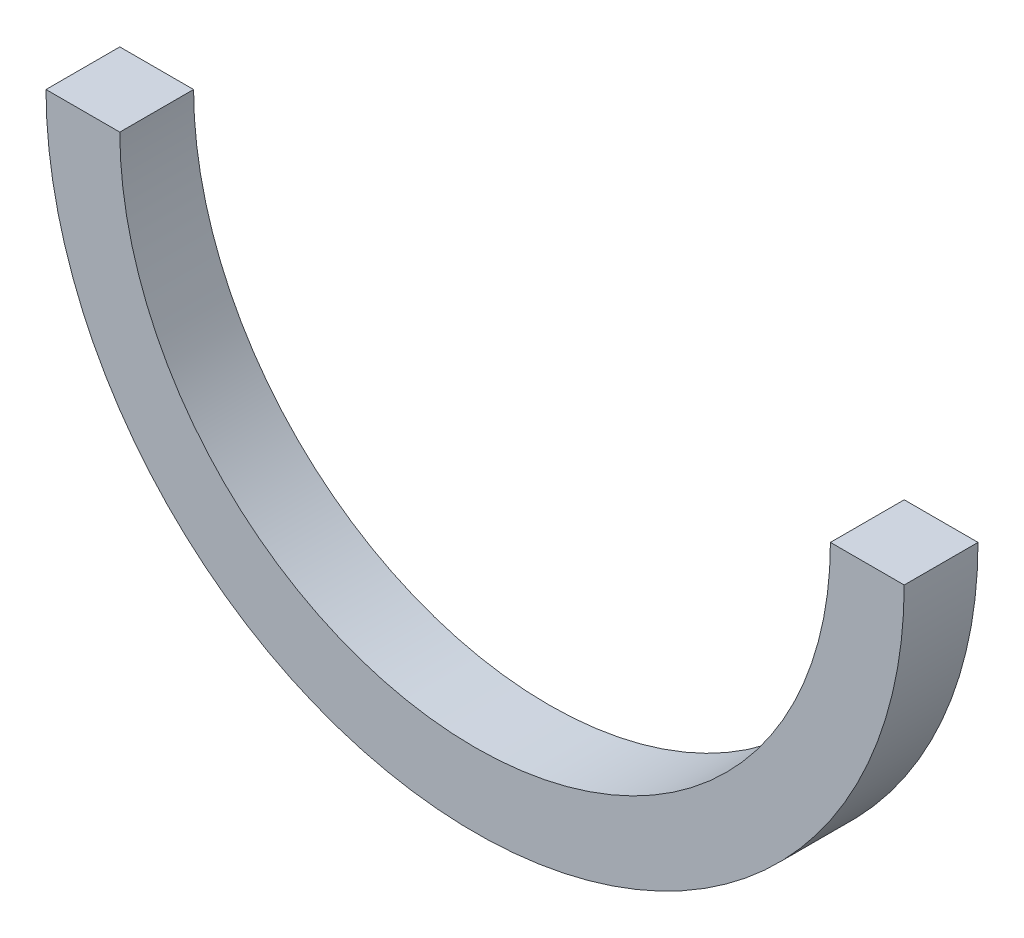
from build123d import *

# Parameters (mm, degrees)
SKETCH2_W = 18.25
SKETCH2_H = 18.25


with BuildPart() as part:
    # Sweep1: sweep along a path in Sketch1
    with BuildLine(Plane.XY) as sweep1_path:
        ThreePointArc((97, 0), (0, -97), (-97, 0))
    # Sketch2 → Sweep1 (sweep)
    with BuildSketch(Plane(origin=(0, 0, 0), x_dir=(1, 0, 0), z_dir=(0, 1, 0))):
        with Locations((-97, 0)):
            Rectangle(SKETCH2_W, SKETCH2_H)
    sweep(path=sweep1_path.line)


solid = part.part
